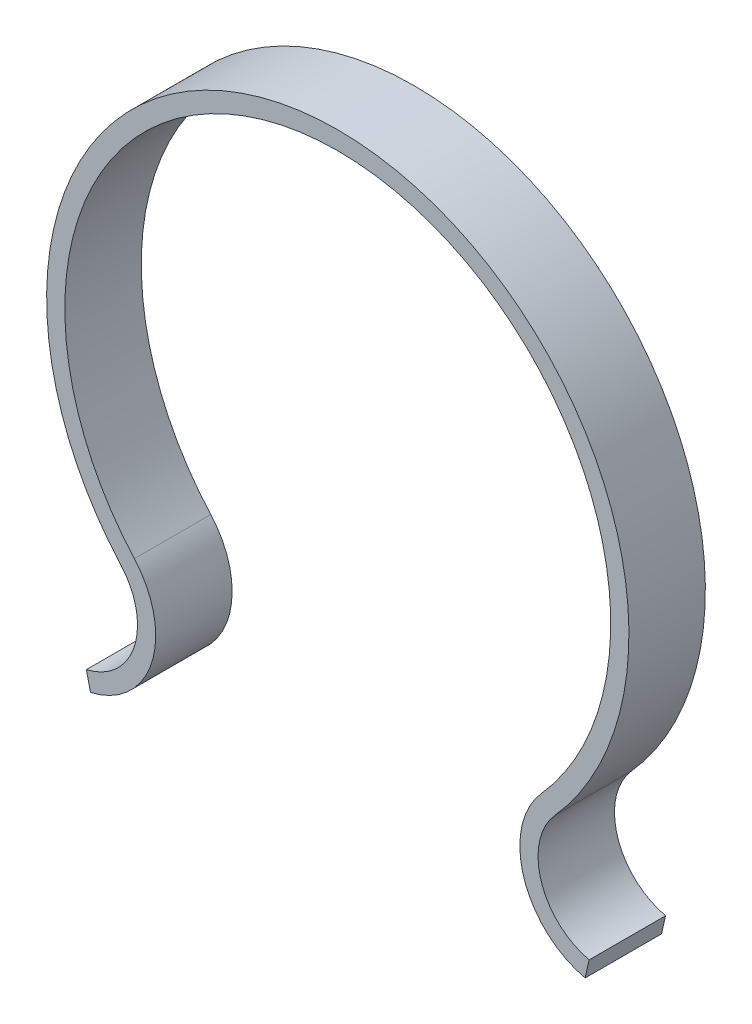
from build123d import *

# Parameters (mm, degrees)
EXTRUDE_THIN1_DEPTH = 2.1


with BuildPart() as part:
    # Sketch1 → Extrude-Thin1 (new body)
    with BuildSketch(Plane.XY):
        with BuildLine():
            ThreePointArc((-6.907045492, -8.298482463), (-5.587833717, -7.085866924), (-5.962579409, -5.333633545))
            ThreePointArc((-5.962579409, -5.333633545), (0, 8), (5.962579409, -5.333633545))
            ThreePointArc((5.962579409, -5.333633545), (5.587833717, -7.085866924), (6.907045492, -8.298482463))
            Line((6.907045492, -8.298482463), (6.795864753, -8.78596461))
            ThreePointArc((6.795864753, -8.78596461), (5.111422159, -7.237629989), (5.589918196, -5.000281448))
            ThreePointArc((5.589918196, -5.000281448), (0, 7.5), (-5.589918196, -5.000281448))
            ThreePointArc((-5.589918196, -5.000281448), (-5.111422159, -7.237629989), (-6.795864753, -8.78596461))
            Line((-6.795864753, -8.78596461), (-6.907045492, -8.298482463))
        make_face()
    extrude(amount=EXTRUDE_THIN1_DEPTH)


solid = part.part
